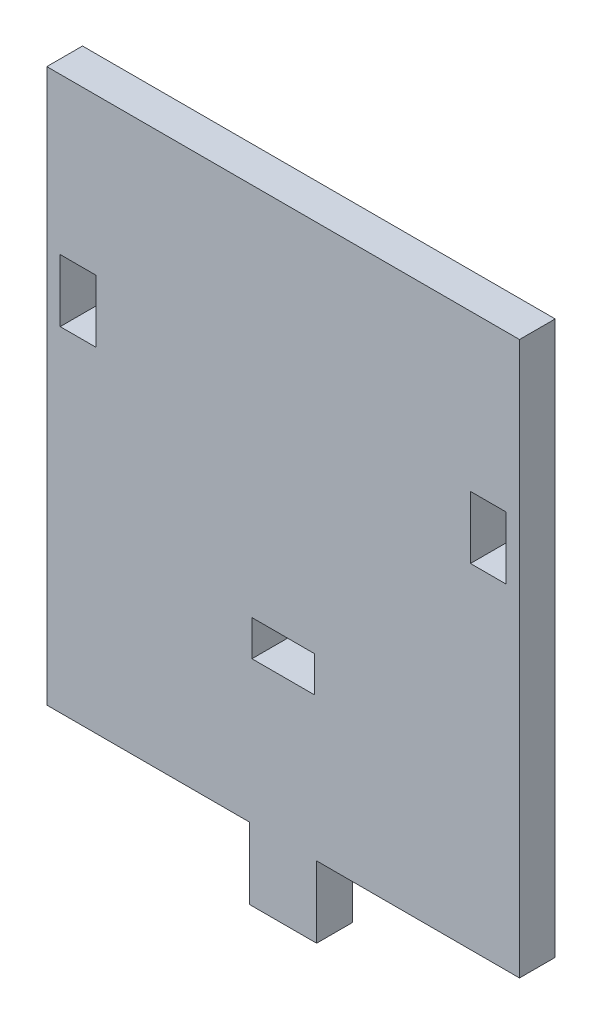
ISO-10303-21;
HEADER;
FILE_DESCRIPTION(('STEP AP214'),'2;1');
FILE_NAME('part.step','',(''),(''),'','','');
FILE_SCHEMA(('AUTOMOTIVE_DESIGN { 1 0 10303 214 1 1 1 1 }'));
ENDSEC;
DATA;
#1=APPLICATION_CONTEXT('core data for automotive mechanical design processes');
#2=APPLICATION_PROTOCOL_DEFINITION('international standard','automotive_design',2000,#1);
#3=PRODUCT_CONTEXT('',#1,'mechanical');
#4=PRODUCT('Part','Part','',(#3));
#5=PRODUCT_RELATED_PRODUCT_CATEGORY('part','',(#4));
#6=PRODUCT_DEFINITION_FORMATION('','',#4);
#7=PRODUCT_DEFINITION_CONTEXT('part definition',#1,'design');
#8=PRODUCT_DEFINITION('design','',#6,#7);
#9=PRODUCT_DEFINITION_SHAPE('','',#8);
#10=(LENGTH_UNIT() NAMED_UNIT(*) SI_UNIT(.MILLI.,.METRE.));
#11=(NAMED_UNIT(*) PLANE_ANGLE_UNIT() SI_UNIT($,.RADIAN.));
#12=(NAMED_UNIT(*) SI_UNIT($,.STERADIAN.) SOLID_ANGLE_UNIT());
#13=UNCERTAINTY_MEASURE_WITH_UNIT(LENGTH_MEASURE(1.E-05),#10,'distance_accuracy_value','');
#14=(GEOMETRIC_REPRESENTATION_CONTEXT(3) GLOBAL_UNCERTAINTY_ASSIGNED_CONTEXT((#13)) GLOBAL_UNIT_ASSIGNED_CONTEXT((#10,
#11,#12)) REPRESENTATION_CONTEXT('',''));
#15=CARTESIAN_POINT('',(0.,0.,0.));
#16=DIRECTION('',(0.,0.,1.));
#17=DIRECTION('',(1.,0.,0.));
#18=AXIS2_PLACEMENT_3D('',#15,#16,#17);
#19=CARTESIAN_POINT('',(-0.298886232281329,0.,4.));
#20=DIRECTION('',(1.,0.,0.));
#21=DIRECTION('',(0.,1.,0.));
#22=AXIS2_PLACEMENT_3D('',#19,#20,#21);
#23=PLANE('',#22);
#24=DIRECTION('',(0.,-1.,0.));
#25=VECTOR('',#24,1.);
#26=CARTESIAN_POINT('',(-0.298886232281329,0.,0.));
#27=LINE('',#26,#25);
#28=CARTESIAN_POINT('',(-0.298886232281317,-55.3647060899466,0.));
#29=VERTEX_POINT('',#28);
#30=CARTESIAN_POINT('',(-0.298886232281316,-63.3647060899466,0.));
#31=VERTEX_POINT('',#30);
#32=EDGE_CURVE('E283',#29,#31,#27,.T.);
#33=ORIENTED_EDGE('',*,*,#32,.F.);
#34=DIRECTION('',(0.,0.,-1.));
#35=VECTOR('',#34,1.);
#36=CARTESIAN_POINT('',(-0.298886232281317,-55.3647060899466,4.));
#37=LINE('',#36,#35);
#38=CARTESIAN_POINT('',(-0.298886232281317,-55.3647060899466,4.));
#39=VERTEX_POINT('',#38);
#40=EDGE_CURVE('E11',#39,#29,#37,.T.);
#41=ORIENTED_EDGE('',*,*,#40,.F.);
#42=DIRECTION('',(0.,-1.,0.));
#43=VECTOR('',#42,1.);
#44=CARTESIAN_POINT('',(-0.298886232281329,0.,4.));
#45=LINE('',#44,#43);
#46=CARTESIAN_POINT('',(-0.298886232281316,-63.3647060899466,4.));
#47=VERTEX_POINT('',#46);
#48=EDGE_CURVE('E334',#39,#47,#45,.T.);
#49=ORIENTED_EDGE('',*,*,#48,.T.);
#50=DIRECTION('',(0.,0.,-1.));
#51=VECTOR('',#50,1.);
#52=CARTESIAN_POINT('',(-0.298886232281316,-63.3647060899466,4.));
#53=LINE('',#52,#51);
#54=EDGE_CURVE('E121',#47,#31,#53,.T.);
#55=ORIENTED_EDGE('',*,*,#54,.T.);
#56=EDGE_LOOP('',(#33,#41,#49,#55));
#57=FACE_BOUND('',#56,.T.);
#58=ADVANCED_FACE('F32',(#57),#23,.T.);
#59=CARTESIAN_POINT('',(0.,-55.3647060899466,4.));
#60=DIRECTION('',(0.,1.,0.));
#61=DIRECTION('',(0.,0.,1.));
#62=AXIS2_PLACEMENT_3D('',#59,#60,#61);
#63=PLANE('',#62);
#64=DIRECTION('',(1.,0.,0.));
#65=VECTOR('',#64,1.);
#66=CARTESIAN_POINT('',(0.,-55.3647060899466,0.));
#67=LINE('',#66,#65);
#68=CARTESIAN_POINT('',(22.4511137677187,-55.3647060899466,0.));
#69=VERTEX_POINT('',#68);
#70=EDGE_CURVE('E285',#29,#69,#67,.T.);
#71=ORIENTED_EDGE('',*,*,#70,.T.);
#72=DIRECTION('',(0.,0.,-1.));
#73=VECTOR('',#72,1.);
#74=CARTESIAN_POINT('',(22.4511137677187,-55.3647060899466,4.));
#75=LINE('',#74,#73);
#76=CARTESIAN_POINT('',(22.4511137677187,-55.3647060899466,4.));
#77=VERTEX_POINT('',#76);
#78=EDGE_CURVE('E42',#77,#69,#75,.T.);
#79=ORIENTED_EDGE('',*,*,#78,.F.);
#80=DIRECTION('',(1.,0.,0.));
#81=VECTOR('',#80,1.);
#82=CARTESIAN_POINT('',(0.,-55.3647060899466,4.));
#83=LINE('',#82,#81);
#84=EDGE_CURVE('E336',#39,#77,#83,.T.);
#85=ORIENTED_EDGE('',*,*,#84,.F.);
#86=ORIENTED_EDGE('',*,*,#40,.T.);
#87=EDGE_LOOP('',(#71,#79,#85,#86));
#88=FACE_BOUND('',#87,.T.);
#89=ADVANCED_FACE('F367',(#88),#63,.F.);
#90=CARTESIAN_POINT('',(22.4511137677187,0.,4.));
#91=DIRECTION('',(1.,0.,0.));
#92=DIRECTION('',(0.,1.,0.));
#93=AXIS2_PLACEMENT_3D('',#90,#91,#92);
#94=PLANE('',#93);
#95=DIRECTION('',(0.,-1.,0.));
#96=VECTOR('',#95,1.);
#97=CARTESIAN_POINT('',(22.4511137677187,0.,0.));
#98=LINE('',#97,#96);
#99=CARTESIAN_POINT('',(22.4511137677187,6.63529391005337,0.));
#100=VERTEX_POINT('',#99);
#101=EDGE_CURVE('E288',#100,#69,#98,.T.);
#102=ORIENTED_EDGE('',*,*,#101,.F.);
#103=DIRECTION('',(0.,0.,-1.));
#104=VECTOR('',#103,1.);
#105=CARTESIAN_POINT('',(22.4511137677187,6.63529391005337,4.));
#106=LINE('',#105,#104);
#107=CARTESIAN_POINT('',(22.4511137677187,6.63529391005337,4.));
#108=VERTEX_POINT('',#107);
#109=EDGE_CURVE('E210',#108,#100,#106,.T.);
#110=ORIENTED_EDGE('',*,*,#109,.F.);
#111=DIRECTION('',(0.,-1.,0.));
#112=VECTOR('',#111,1.);
#113=CARTESIAN_POINT('',(22.4511137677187,0.,4.));
#114=LINE('',#113,#112);
#115=EDGE_CURVE('E338',#108,#77,#114,.T.);
#116=ORIENTED_EDGE('',*,*,#115,.T.);
#117=ORIENTED_EDGE('',*,*,#78,.T.);
#118=EDGE_LOOP('',(#102,#110,#116,#117));
#119=FACE_BOUND('',#118,.T.);
#120=ADVANCED_FACE('F352',(#119),#94,.T.);
#121=CARTESIAN_POINT('',(0.,6.63529391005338,4.));
#122=DIRECTION('',(0.,1.,0.));
#123=DIRECTION('',(-1.,0.,0.));
#124=AXIS2_PLACEMENT_3D('',#121,#122,#123);
#125=PLANE('',#124);
#126=DIRECTION('',(1.,0.,0.));
#127=VECTOR('',#126,1.);
#128=CARTESIAN_POINT('',(0.,6.63529391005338,0.));
#129=LINE('',#128,#127);
#130=CARTESIAN_POINT('',(-30.5488862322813,6.63529391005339,0.));
#131=VERTEX_POINT('',#130);
#132=EDGE_CURVE('E291',#131,#100,#129,.T.);
#133=ORIENTED_EDGE('',*,*,#132,.F.);
#134=DIRECTION('',(0.,0.,-1.));
#135=VECTOR('',#134,1.);
#136=CARTESIAN_POINT('',(-30.5488862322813,6.63529391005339,4.));
#137=LINE('',#136,#135);
#138=CARTESIAN_POINT('',(-30.5488862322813,6.63529391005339,4.));
#139=VERTEX_POINT('',#138);
#140=EDGE_CURVE('E204',#139,#131,#137,.T.);
#141=ORIENTED_EDGE('',*,*,#140,.F.);
#142=DIRECTION('',(1.,0.,0.));
#143=VECTOR('',#142,1.);
#144=CARTESIAN_POINT('',(0.,6.63529391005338,4.));
#145=LINE('',#144,#143);
#146=EDGE_CURVE('E341',#139,#108,#145,.T.);
#147=ORIENTED_EDGE('',*,*,#146,.T.);
#148=ORIENTED_EDGE('',*,*,#109,.T.);
#149=EDGE_LOOP('',(#133,#141,#147,#148));
#150=FACE_BOUND('',#149,.T.);
#151=ADVANCED_FACE('F346',(#150),#125,.T.);
#152=CARTESIAN_POINT('',(-30.5488862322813,0.,4.));
#153=DIRECTION('',(1.,0.,0.));
#154=DIRECTION('',(0.,1.,0.));
#155=AXIS2_PLACEMENT_3D('',#152,#153,#154);
#156=PLANE('',#155);
#157=DIRECTION('',(0.,-1.,0.));
#158=VECTOR('',#157,1.);
#159=CARTESIAN_POINT('',(-30.5488862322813,0.,0.));
#160=LINE('',#159,#158);
#161=CARTESIAN_POINT('',(-30.5488862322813,-55.3647060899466,0.));
#162=VERTEX_POINT('',#161);
#163=EDGE_CURVE('E294',#131,#162,#160,.T.);
#164=ORIENTED_EDGE('',*,*,#163,.T.);
#165=DIRECTION('',(0.,0.,-1.));
#166=VECTOR('',#165,1.);
#167=CARTESIAN_POINT('',(-30.5488862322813,-55.3647060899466,4.));
#168=LINE('',#167,#166);
#169=CARTESIAN_POINT('',(-30.5488862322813,-55.3647060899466,4.));
#170=VERTEX_POINT('',#169);
#171=EDGE_CURVE('E202',#170,#162,#168,.T.);
#172=ORIENTED_EDGE('',*,*,#171,.F.);
#173=DIRECTION('',(0.,-1.,0.));
#174=VECTOR('',#173,1.);
#175=CARTESIAN_POINT('',(-30.5488862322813,0.,4.));
#176=LINE('',#175,#174);
#177=EDGE_CURVE('E195',#139,#170,#176,.T.);
#178=ORIENTED_EDGE('',*,*,#177,.F.);
#179=ORIENTED_EDGE('',*,*,#140,.T.);
#180=EDGE_LOOP('',(#164,#172,#178,#179));
#181=FACE_BOUND('',#180,.T.);
#182=ADVANCED_FACE('F357',(#181),#156,.F.);
#183=CARTESIAN_POINT('',(0.,-55.3647060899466,4.));
#184=DIRECTION('',(0.,1.,0.));
#185=DIRECTION('',(0.,0.,1.));
#186=AXIS2_PLACEMENT_3D('',#183,#184,#185);
#187=PLANE('',#186);
#188=DIRECTION('',(1.,0.,0.));
#189=VECTOR('',#188,1.);
#190=CARTESIAN_POINT('',(0.,-55.3647060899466,0.));
#191=LINE('',#190,#189);
#192=CARTESIAN_POINT('',(-7.79888623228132,-55.3647060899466,0.));
#193=VERTEX_POINT('',#192);
#194=EDGE_CURVE('E201',#162,#193,#191,.T.);
#195=ORIENTED_EDGE('',*,*,#194,.T.);
#196=DIRECTION('',(0.,0.,-1.));
#197=VECTOR('',#196,1.);
#198=CARTESIAN_POINT('',(-7.79888623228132,-55.3647060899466,4.));
#199=LINE('',#198,#197);
#200=CARTESIAN_POINT('',(-7.79888623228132,-55.3647060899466,4.));
#201=VERTEX_POINT('',#200);
#202=EDGE_CURVE('E186',#201,#193,#199,.T.);
#203=ORIENTED_EDGE('',*,*,#202,.F.);
#204=DIRECTION('',(1.,0.,0.));
#205=VECTOR('',#204,1.);
#206=CARTESIAN_POINT('',(0.,-55.3647060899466,4.));
#207=LINE('',#206,#205);
#208=EDGE_CURVE('E189',#170,#201,#207,.T.);
#209=ORIENTED_EDGE('',*,*,#208,.F.);
#210=ORIENTED_EDGE('',*,*,#171,.T.);
#211=EDGE_LOOP('',(#195,#203,#209,#210));
#212=FACE_BOUND('',#211,.T.);
#213=ADVANCED_FACE('F200',(#212),#187,.F.);
#214=CARTESIAN_POINT('',(-7.79888623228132,0.,4.));
#215=DIRECTION('',(1.,0.,0.));
#216=DIRECTION('',(0.,1.,0.));
#217=AXIS2_PLACEMENT_3D('',#214,#215,#216);
#218=PLANE('',#217);
#219=DIRECTION('',(0.,-1.,0.));
#220=VECTOR('',#219,1.);
#221=CARTESIAN_POINT('',(-7.79888623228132,0.,0.));
#222=LINE('',#221,#220);
#223=CARTESIAN_POINT('',(-7.79888623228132,-63.3647060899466,0.));
#224=VERTEX_POINT('',#223);
#225=EDGE_CURVE('E298',#193,#224,#222,.T.);
#226=ORIENTED_EDGE('',*,*,#225,.T.);
#227=DIRECTION('',(0.,0.,-1.));
#228=VECTOR('',#227,1.);
#229=CARTESIAN_POINT('',(-7.79888623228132,-63.3647060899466,4.));
#230=LINE('',#229,#228);
#231=CARTESIAN_POINT('',(-7.79888623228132,-63.3647060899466,4.));
#232=VERTEX_POINT('',#231);
#233=EDGE_CURVE('E188',#232,#224,#230,.T.);
#234=ORIENTED_EDGE('',*,*,#233,.F.);
#235=DIRECTION('',(0.,-1.,0.));
#236=VECTOR('',#235,1.);
#237=CARTESIAN_POINT('',(-7.79888623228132,0.,4.));
#238=LINE('',#237,#236);
#239=EDGE_CURVE('E181',#201,#232,#238,.T.);
#240=ORIENTED_EDGE('',*,*,#239,.F.);
#241=ORIENTED_EDGE('',*,*,#202,.T.);
#242=EDGE_LOOP('',(#226,#234,#240,#241));
#243=FACE_BOUND('',#242,.T.);
#244=ADVANCED_FACE('F184',(#243),#218,.F.);
#245=CARTESIAN_POINT('',(0.,-35.3647060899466,4.));
#246=DIRECTION('',(0.,1.,0.));
#247=DIRECTION('',(0.,0.,1.));
#248=AXIS2_PLACEMENT_3D('',#245,#246,#247);
#249=PLANE('',#248);
#250=DIRECTION('',(1.,0.,0.));
#251=VECTOR('',#250,1.);
#252=CARTESIAN_POINT('',(0.,-35.3647060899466,0.));
#253=LINE('',#252,#251);
#254=CARTESIAN_POINT('',(-7.54888623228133,-35.3647060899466,0.));
#255=VERTEX_POINT('',#254);
#256=CARTESIAN_POINT('',(-0.548886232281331,-35.3647060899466,0.));
#257=VERTEX_POINT('',#256);
#258=EDGE_CURVE('E271',#255,#257,#253,.T.);
#259=ORIENTED_EDGE('',*,*,#258,.T.);
#260=DIRECTION('',(0.,0.,-1.));
#261=VECTOR('',#260,1.);
#262=CARTESIAN_POINT('',(-0.548886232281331,-35.3647060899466,4.));
#263=LINE('',#262,#261);
#264=CARTESIAN_POINT('',(-0.548886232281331,-35.3647060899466,4.));
#265=VERTEX_POINT('',#264);
#266=EDGE_CURVE('E220',#265,#257,#263,.T.);
#267=ORIENTED_EDGE('',*,*,#266,.F.);
#268=DIRECTION('',(1.,0.,0.));
#269=VECTOR('',#268,1.);
#270=CARTESIAN_POINT('',(0.,-35.3647060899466,4.));
#271=LINE('',#270,#269);
#272=CARTESIAN_POINT('',(-7.54888623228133,-35.3647060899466,4.));
#273=VERTEX_POINT('',#272);
#274=EDGE_CURVE('E323',#273,#265,#271,.T.);
#275=ORIENTED_EDGE('',*,*,#274,.F.);
#276=DIRECTION('',(0.,0.,-1.));
#277=VECTOR('',#276,1.);
#278=CARTESIAN_POINT('',(-7.54888623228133,-35.3647060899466,4.));
#279=LINE('',#278,#277);
#280=EDGE_CURVE('E213',#273,#255,#279,.T.);
#281=ORIENTED_EDGE('',*,*,#280,.T.);
#282=EDGE_LOOP('',(#259,#267,#275,#281));
#283=FACE_BOUND('',#282,.T.);
#284=ADVANCED_FACE('F390',(#283),#249,.F.);
#285=CARTESIAN_POINT('',(-0.548886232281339,0.,4.));
#286=DIRECTION('',(1.,0.,0.));
#287=DIRECTION('',(0.,1.,0.));
#288=AXIS2_PLACEMENT_3D('',#285,#286,#287);
#289=PLANE('',#288);
#290=DIRECTION('',(0.,-1.,0.));
#291=VECTOR('',#290,1.);
#292=CARTESIAN_POINT('',(-0.548886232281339,0.,0.));
#293=LINE('',#292,#291);
#294=CARTESIAN_POINT('',(-0.548886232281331,-39.3647060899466,0.));
#295=VERTEX_POINT('',#294);
#296=EDGE_CURVE('E274',#257,#295,#293,.T.);
#297=ORIENTED_EDGE('',*,*,#296,.T.);
#298=DIRECTION('',(0.,0.,-1.));
#299=VECTOR('',#298,1.);
#300=CARTESIAN_POINT('',(-0.548886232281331,-39.3647060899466,4.));
#301=LINE('',#300,#299);
#302=CARTESIAN_POINT('',(-0.548886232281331,-39.3647060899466,4.));
#303=VERTEX_POINT('',#302);
#304=EDGE_CURVE('E218',#303,#295,#301,.T.);
#305=ORIENTED_EDGE('',*,*,#304,.F.);
#306=DIRECTION('',(0.,-1.,0.));
#307=VECTOR('',#306,1.);
#308=CARTESIAN_POINT('',(-0.548886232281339,0.,4.));
#309=LINE('',#308,#307);
#310=EDGE_CURVE('E326',#265,#303,#309,.T.);
#311=ORIENTED_EDGE('',*,*,#310,.F.);
#312=ORIENTED_EDGE('',*,*,#266,.T.);
#313=EDGE_LOOP('',(#297,#305,#311,#312));
#314=FACE_BOUND('',#313,.T.);
#315=ADVANCED_FACE('F386',(#314),#289,.F.);
#316=CARTESIAN_POINT('',(0.,-39.3647060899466,4.));
#317=DIRECTION('',(0.,1.,0.));
#318=DIRECTION('',(0.,0.,1.));
#319=AXIS2_PLACEMENT_3D('',#316,#317,#318);
#320=PLANE('',#319);
#321=DIRECTION('',(1.,0.,0.));
#322=VECTOR('',#321,1.);
#323=CARTESIAN_POINT('',(0.,-39.3647060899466,0.));
#324=LINE('',#323,#322);
#325=CARTESIAN_POINT('',(-7.54888623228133,-39.3647060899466,0.));
#326=VERTEX_POINT('',#325);
#327=EDGE_CURVE('E277',#326,#295,#324,.T.);
#328=ORIENTED_EDGE('',*,*,#327,.F.);
#329=DIRECTION('',(0.,0.,-1.));
#330=VECTOR('',#329,1.);
#331=CARTESIAN_POINT('',(-7.54888623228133,-39.3647060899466,4.));
#332=LINE('',#331,#330);
#333=CARTESIAN_POINT('',(-7.54888623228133,-39.3647060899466,4.));
#334=VERTEX_POINT('',#333);
#335=EDGE_CURVE('E215',#334,#326,#332,.T.);
#336=ORIENTED_EDGE('',*,*,#335,.F.);
#337=DIRECTION('',(1.,0.,0.));
#338=VECTOR('',#337,1.);
#339=CARTESIAN_POINT('',(0.,-39.3647060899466,4.));
#340=LINE('',#339,#338);
#341=EDGE_CURVE('E328',#334,#303,#340,.T.);
#342=ORIENTED_EDGE('',*,*,#341,.T.);
#343=ORIENTED_EDGE('',*,*,#304,.T.);
#344=EDGE_LOOP('',(#328,#336,#342,#343));
#345=FACE_BOUND('',#344,.T.);
#346=ADVANCED_FACE('F382',(#345),#320,.T.);
#347=CARTESIAN_POINT('',(0.,-10.8647060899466,4.));
#348=DIRECTION('',(0.,1.,0.));
#349=DIRECTION('',(0.,0.,1.));
#350=AXIS2_PLACEMENT_3D('',#347,#348,#349);
#351=PLANE('',#350);
#352=DIRECTION('',(1.,0.,0.));
#353=VECTOR('',#352,1.);
#354=CARTESIAN_POINT('',(0.,-10.8647060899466,0.));
#355=LINE('',#354,#353);
#356=CARTESIAN_POINT('',(-29.0488862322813,-10.8647060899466,0.));
#357=VERTEX_POINT('',#356);
#358=CARTESIAN_POINT('',(-25.0488862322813,-10.8647060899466,0.));
#359=VERTEX_POINT('',#358);
#360=EDGE_CURVE('E259',#357,#359,#355,.T.);
#361=ORIENTED_EDGE('',*,*,#360,.T.);
#362=DIRECTION('',(0.,0.,-1.));
#363=VECTOR('',#362,1.);
#364=CARTESIAN_POINT('',(-25.0488862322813,-10.8647060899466,4.));
#365=LINE('',#364,#363);
#366=CARTESIAN_POINT('',(-25.0488862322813,-10.8647060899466,4.));
#367=VERTEX_POINT('',#366);
#368=EDGE_CURVE('E216',#367,#359,#365,.T.);
#369=ORIENTED_EDGE('',*,*,#368,.F.);
#370=DIRECTION('',(1.,0.,0.));
#371=VECTOR('',#370,1.);
#372=CARTESIAN_POINT('',(0.,-10.8647060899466,4.));
#373=LINE('',#372,#371);
#374=CARTESIAN_POINT('',(-29.0488862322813,-10.8647060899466,4.));
#375=VERTEX_POINT('',#374);
#376=EDGE_CURVE('E312',#375,#367,#373,.T.);
#377=ORIENTED_EDGE('',*,*,#376,.F.);
#378=DIRECTION('',(0.,0.,-1.));
#379=VECTOR('',#378,1.);
#380=CARTESIAN_POINT('',(-29.0488862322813,-10.8647060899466,4.));
#381=LINE('',#380,#379);
#382=EDGE_CURVE('E223',#375,#357,#381,.T.);
#383=ORIENTED_EDGE('',*,*,#382,.T.);
#384=EDGE_LOOP('',(#361,#369,#377,#383));
#385=FACE_BOUND('',#384,.T.);
#386=ADVANCED_FACE('F385',(#385),#351,.F.);
#387=CARTESIAN_POINT('',(-25.0488862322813,0.,4.));
#388=DIRECTION('',(1.,0.,0.));
#389=DIRECTION('',(0.,0.,-1.));
#390=AXIS2_PLACEMENT_3D('',#387,#388,#389);
#391=PLANE('',#390);
#392=DIRECTION('',(0.,-1.,0.));
#393=VECTOR('',#392,1.);
#394=CARTESIAN_POINT('',(-25.0488862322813,0.,0.));
#395=LINE('',#394,#393);
#396=CARTESIAN_POINT('',(-25.0488862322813,-17.8647060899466,0.));
#397=VERTEX_POINT('',#396);
#398=EDGE_CURVE('E262',#359,#397,#395,.T.);
#399=ORIENTED_EDGE('',*,*,#398,.T.);
#400=DIRECTION('',(0.,0.,-1.));
#401=VECTOR('',#400,1.);
#402=CARTESIAN_POINT('',(-25.0488862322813,-17.8647060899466,4.));
#403=LINE('',#402,#401);
#404=CARTESIAN_POINT('',(-25.0488862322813,-17.8647060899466,4.));
#405=VERTEX_POINT('',#404);
#406=EDGE_CURVE('E227',#405,#397,#403,.T.);
#407=ORIENTED_EDGE('',*,*,#406,.F.);
#408=DIRECTION('',(0.,-1.,0.));
#409=VECTOR('',#408,1.);
#410=CARTESIAN_POINT('',(-25.0488862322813,0.,4.));
#411=LINE('',#410,#409);
#412=EDGE_CURVE('E315',#367,#405,#411,.T.);
#413=ORIENTED_EDGE('',*,*,#412,.F.);
#414=ORIENTED_EDGE('',*,*,#368,.T.);
#415=EDGE_LOOP('',(#399,#407,#413,#414));
#416=FACE_BOUND('',#415,.T.);
#417=ADVANCED_FACE('F402',(#416),#391,.F.);
#418=CARTESIAN_POINT('',(0.,-17.8647060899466,4.));
#419=DIRECTION('',(0.,1.,0.));
#420=DIRECTION('',(0.,0.,1.));
#421=AXIS2_PLACEMENT_3D('',#418,#419,#420);
#422=PLANE('',#421);
#423=DIRECTION('',(1.,0.,0.));
#424=VECTOR('',#423,1.);
#425=CARTESIAN_POINT('',(0.,-17.8647060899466,0.));
#426=LINE('',#425,#424);
#427=CARTESIAN_POINT('',(-29.0488862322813,-17.8647060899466,0.));
#428=VERTEX_POINT('',#427);
#429=EDGE_CURVE('E265',#428,#397,#426,.T.);
#430=ORIENTED_EDGE('',*,*,#429,.F.);
#431=DIRECTION('',(0.,0.,-1.));
#432=VECTOR('',#431,1.);
#433=CARTESIAN_POINT('',(-29.0488862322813,-17.8647060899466,4.));
#434=LINE('',#433,#432);
#435=CARTESIAN_POINT('',(-29.0488862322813,-17.8647060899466,4.));
#436=VERTEX_POINT('',#435);
#437=EDGE_CURVE('E225',#436,#428,#434,.T.);
#438=ORIENTED_EDGE('',*,*,#437,.F.);
#439=DIRECTION('',(1.,0.,0.));
#440=VECTOR('',#439,1.);
#441=CARTESIAN_POINT('',(0.,-17.8647060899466,4.));
#442=LINE('',#441,#440);
#443=EDGE_CURVE('E317',#436,#405,#442,.T.);
#444=ORIENTED_EDGE('',*,*,#443,.T.);
#445=ORIENTED_EDGE('',*,*,#406,.T.);
#446=EDGE_LOOP('',(#430,#438,#444,#445));
#447=FACE_BOUND('',#446,.T.);
#448=ADVANCED_FACE('F399',(#447),#422,.T.);
#449=CARTESIAN_POINT('',(0.,-10.8647060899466,4.));
#450=DIRECTION('',(0.,1.,0.));
#451=DIRECTION('',(0.,0.,1.));
#452=AXIS2_PLACEMENT_3D('',#449,#450,#451);
#453=PLANE('',#452);
#454=DIRECTION('',(1.,0.,0.));
#455=VECTOR('',#454,1.);
#456=CARTESIAN_POINT('',(0.,-10.8647060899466,0.));
#457=LINE('',#456,#455);
#458=CARTESIAN_POINT('',(16.9511137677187,-10.8647060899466,0.));
#459=VERTEX_POINT('',#458);
#460=CARTESIAN_POINT('',(20.9511137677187,-10.8647060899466,0.));
#461=VERTEX_POINT('',#460);
#462=EDGE_CURVE('E247',#459,#461,#457,.T.);
#463=ORIENTED_EDGE('',*,*,#462,.T.);
#464=DIRECTION('',(0.,0.,-1.));
#465=VECTOR('',#464,1.);
#466=CARTESIAN_POINT('',(20.9511137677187,-10.8647060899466,4.));
#467=LINE('',#466,#465);
#468=CARTESIAN_POINT('',(20.9511137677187,-10.8647060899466,4.));
#469=VERTEX_POINT('',#468);
#470=EDGE_CURVE('E36',#469,#461,#467,.T.);
#471=ORIENTED_EDGE('',*,*,#470,.F.);
#472=DIRECTION('',(1.,0.,0.));
#473=VECTOR('',#472,1.);
#474=CARTESIAN_POINT('',(0.,-10.8647060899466,4.));
#475=LINE('',#474,#473);
#476=CARTESIAN_POINT('',(16.9511137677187,-10.8647060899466,4.));
#477=VERTEX_POINT('',#476);
#478=EDGE_CURVE('E300',#477,#469,#475,.T.);
#479=ORIENTED_EDGE('',*,*,#478,.F.);
#480=DIRECTION('',(0.,0.,-1.));
#481=VECTOR('',#480,1.);
#482=CARTESIAN_POINT('',(16.9511137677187,-10.8647060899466,4.));
#483=LINE('',#482,#481);
#484=EDGE_CURVE('E231',#477,#459,#483,.T.);
#485=ORIENTED_EDGE('',*,*,#484,.T.);
#486=EDGE_LOOP('',(#463,#471,#479,#485));
#487=FACE_BOUND('',#486,.T.);
#488=ADVANCED_FACE('F34',(#487),#453,.F.);
#489=CARTESIAN_POINT('',(20.9511137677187,0.,4.));
#490=DIRECTION('',(1.,0.,0.));
#491=DIRECTION('',(0.,0.,-1.));
#492=AXIS2_PLACEMENT_3D('',#489,#490,#491);
#493=PLANE('',#492);
#494=DIRECTION('',(0.,-1.,0.));
#495=VECTOR('',#494,1.);
#496=CARTESIAN_POINT('',(20.9511137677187,0.,0.));
#497=LINE('',#496,#495);
#498=CARTESIAN_POINT('',(20.9511137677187,-17.8647060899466,0.));
#499=VERTEX_POINT('',#498);
#500=EDGE_CURVE('E242',#461,#499,#497,.T.);
#501=ORIENTED_EDGE('',*,*,#500,.T.);
#502=DIRECTION('',(0.,0.,-1.));
#503=VECTOR('',#502,1.);
#504=CARTESIAN_POINT('',(20.9511137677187,-17.8647060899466,4.));
#505=LINE('',#504,#503);
#506=CARTESIAN_POINT('',(20.9511137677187,-17.8647060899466,4.));
#507=VERTEX_POINT('',#506);
#508=EDGE_CURVE('E234',#507,#499,#505,.T.);
#509=ORIENTED_EDGE('',*,*,#508,.F.);
#510=DIRECTION('',(0.,-1.,0.));
#511=VECTOR('',#510,1.);
#512=CARTESIAN_POINT('',(20.9511137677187,0.,4.));
#513=LINE('',#512,#511);
#514=EDGE_CURVE('E129',#469,#507,#513,.T.);
#515=ORIENTED_EDGE('',*,*,#514,.F.);
#516=ORIENTED_EDGE('',*,*,#470,.T.);
#517=EDGE_LOOP('',(#501,#509,#515,#516));
#518=FACE_BOUND('',#517,.T.);
#519=ADVANCED_FACE('F241',(#518),#493,.F.);
#520=CARTESIAN_POINT('',(0.,-17.8647060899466,4.));
#521=DIRECTION('',(0.,1.,0.));
#522=DIRECTION('',(0.,0.,1.));
#523=AXIS2_PLACEMENT_3D('',#520,#521,#522);
#524=PLANE('',#523);
#525=DIRECTION('',(1.,0.,0.));
#526=VECTOR('',#525,1.);
#527=CARTESIAN_POINT('',(0.,-17.8647060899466,0.));
#528=LINE('',#527,#526);
#529=CARTESIAN_POINT('',(16.9511137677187,-17.8647060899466,0.));
#530=VERTEX_POINT('',#529);
#531=EDGE_CURVE('E252',#530,#499,#528,.T.);
#532=ORIENTED_EDGE('',*,*,#531,.F.);
#533=DIRECTION('',(0.,0.,-1.));
#534=VECTOR('',#533,1.);
#535=CARTESIAN_POINT('',(16.9511137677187,-17.8647060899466,4.));
#536=LINE('',#535,#534);
#537=CARTESIAN_POINT('',(16.9511137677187,-17.8647060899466,4.));
#538=VERTEX_POINT('',#537);
#539=EDGE_CURVE('E233',#538,#530,#536,.T.);
#540=ORIENTED_EDGE('',*,*,#539,.F.);
#541=DIRECTION('',(1.,0.,0.));
#542=VECTOR('',#541,1.);
#543=CARTESIAN_POINT('',(0.,-17.8647060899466,4.));
#544=LINE('',#543,#542);
#545=EDGE_CURVE('E305',#538,#507,#544,.T.);
#546=ORIENTED_EDGE('',*,*,#545,.T.);
#547=ORIENTED_EDGE('',*,*,#508,.T.);
#548=EDGE_LOOP('',(#532,#540,#546,#547));
#549=FACE_BOUND('',#548,.T.);
#550=ADVANCED_FACE('F380',(#549),#524,.T.);
#551=CARTESIAN_POINT('',(-7.54888623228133,0.,4.));
#552=DIRECTION('',(1.,0.,0.));
#553=DIRECTION('',(0.,0.,-1.));
#554=AXIS2_PLACEMENT_3D('',#551,#552,#553);
#555=PLANE('',#554);
#556=DIRECTION('',(0.,-1.,0.));
#557=VECTOR('',#556,1.);
#558=CARTESIAN_POINT('',(-7.54888623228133,0.,0.));
#559=LINE('',#558,#557);
#560=EDGE_CURVE('E280',#255,#326,#559,.T.);
#561=ORIENTED_EDGE('',*,*,#560,.F.);
#562=ORIENTED_EDGE('',*,*,#280,.F.);
#563=DIRECTION('',(0.,-1.,0.));
#564=VECTOR('',#563,1.);
#565=CARTESIAN_POINT('',(-7.54888623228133,0.,4.));
#566=LINE('',#565,#564);
#567=EDGE_CURVE('E331',#273,#334,#566,.T.);
#568=ORIENTED_EDGE('',*,*,#567,.T.);
#569=ORIENTED_EDGE('',*,*,#335,.T.);
#570=EDGE_LOOP('',(#561,#562,#568,#569));
#571=FACE_BOUND('',#570,.T.);
#572=ADVANCED_FACE('F376',(#571),#555,.T.);
#573=CARTESIAN_POINT('',(-29.0488862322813,0.,4.));
#574=DIRECTION('',(1.,0.,0.));
#575=DIRECTION('',(0.,0.,-1.));
#576=AXIS2_PLACEMENT_3D('',#573,#574,#575);
#577=PLANE('',#576);
#578=DIRECTION('',(0.,-1.,0.));
#579=VECTOR('',#578,1.);
#580=CARTESIAN_POINT('',(-29.0488862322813,0.,0.));
#581=LINE('',#580,#579);
#582=EDGE_CURVE('E268',#357,#428,#581,.T.);
#583=ORIENTED_EDGE('',*,*,#582,.F.);
#584=ORIENTED_EDGE('',*,*,#382,.F.);
#585=DIRECTION('',(0.,-1.,0.));
#586=VECTOR('',#585,1.);
#587=CARTESIAN_POINT('',(-29.0488862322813,0.,4.));
#588=LINE('',#587,#586);
#589=EDGE_CURVE('E320',#375,#436,#588,.T.);
#590=ORIENTED_EDGE('',*,*,#589,.T.);
#591=ORIENTED_EDGE('',*,*,#437,.T.);
#592=EDGE_LOOP('',(#583,#584,#590,#591));
#593=FACE_BOUND('',#592,.T.);
#594=ADVANCED_FACE('F379',(#593),#577,.T.);
#595=CARTESIAN_POINT('',(16.9511137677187,0.,4.));
#596=DIRECTION('',(1.,0.,0.));
#597=DIRECTION('',(0.,0.,-1.));
#598=AXIS2_PLACEMENT_3D('',#595,#596,#597);
#599=PLANE('',#598);
#600=DIRECTION('',(0.,-1.,0.));
#601=VECTOR('',#600,1.);
#602=CARTESIAN_POINT('',(16.9511137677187,0.,0.));
#603=LINE('',#602,#601);
#604=EDGE_CURVE('E257',#459,#530,#603,.T.);
#605=ORIENTED_EDGE('',*,*,#604,.F.);
#606=ORIENTED_EDGE('',*,*,#484,.F.);
#607=DIRECTION('',(0.,-1.,0.));
#608=VECTOR('',#607,1.);
#609=CARTESIAN_POINT('',(16.9511137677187,0.,4.));
#610=LINE('',#609,#608);
#611=EDGE_CURVE('E309',#477,#538,#610,.T.);
#612=ORIENTED_EDGE('',*,*,#611,.T.);
#613=ORIENTED_EDGE('',*,*,#539,.T.);
#614=EDGE_LOOP('',(#605,#606,#612,#613));
#615=FACE_BOUND('',#614,.T.);
#616=ADVANCED_FACE('F397',(#615),#599,.T.);
#617=CARTESIAN_POINT('',(0.,-63.3647060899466,4.));
#618=DIRECTION('',(0.,1.,0.));
#619=DIRECTION('',(0.,0.,1.));
#620=AXIS2_PLACEMENT_3D('',#617,#618,#619);
#621=PLANE('',#620);
#622=DIRECTION('',(1.,0.,0.));
#623=VECTOR('',#622,1.);
#624=CARTESIAN_POINT('',(0.,-63.3647060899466,0.));
#625=LINE('',#624,#623);
#626=EDGE_CURVE('E114',#224,#31,#625,.T.);
#627=ORIENTED_EDGE('',*,*,#626,.T.);
#628=ORIENTED_EDGE('',*,*,#54,.F.);
#629=DIRECTION('',(1.,0.,0.));
#630=VECTOR('',#629,1.);
#631=CARTESIAN_POINT('',(0.,-63.3647060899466,4.));
#632=LINE('',#631,#630);
#633=EDGE_CURVE('E51',#232,#47,#632,.T.);
#634=ORIENTED_EDGE('',*,*,#633,.F.);
#635=ORIENTED_EDGE('',*,*,#233,.T.);
#636=EDGE_LOOP('',(#627,#628,#634,#635));
#637=FACE_BOUND('',#636,.T.);
#638=ADVANCED_FACE('F412',(#637),#621,.F.);
#639=CARTESIAN_POINT('',(0.,0.,4.));
#640=DIRECTION('',(0.,0.,1.));
#641=DIRECTION('',(1.,0.,0.));
#642=AXIS2_PLACEMENT_3D('',#639,#640,#641);
#643=PLANE('',#642);
#644=ORIENTED_EDGE('',*,*,#478,.T.);
#645=ORIENTED_EDGE('',*,*,#514,.T.);
#646=ORIENTED_EDGE('',*,*,#545,.F.);
#647=ORIENTED_EDGE('',*,*,#611,.F.);
#648=EDGE_LOOP('',(#644,#645,#646,#647));
#649=FACE_BOUND('',#648,.T.);
#650=ORIENTED_EDGE('',*,*,#376,.T.);
#651=ORIENTED_EDGE('',*,*,#412,.T.);
#652=ORIENTED_EDGE('',*,*,#443,.F.);
#653=ORIENTED_EDGE('',*,*,#589,.F.);
#654=EDGE_LOOP('',(#650,#651,#652,#653));
#655=FACE_BOUND('',#654,.T.);
#656=ORIENTED_EDGE('',*,*,#274,.T.);
#657=ORIENTED_EDGE('',*,*,#310,.T.);
#658=ORIENTED_EDGE('',*,*,#341,.F.);
#659=ORIENTED_EDGE('',*,*,#567,.F.);
#660=EDGE_LOOP('',(#656,#657,#658,#659));
#661=FACE_BOUND('',#660,.T.);
#662=ORIENTED_EDGE('',*,*,#48,.F.);
#663=ORIENTED_EDGE('',*,*,#84,.T.);
#664=ORIENTED_EDGE('',*,*,#115,.F.);
#665=ORIENTED_EDGE('',*,*,#146,.F.);
#666=ORIENTED_EDGE('',*,*,#177,.T.);
#667=ORIENTED_EDGE('',*,*,#208,.T.);
#668=ORIENTED_EDGE('',*,*,#239,.T.);
#669=ORIENTED_EDGE('',*,*,#633,.T.);
#670=EDGE_LOOP('',(#662,#663,#664,#665,#666,#667,#668,#669));
#671=FACE_BOUND('',#670,.T.);
#672=ADVANCED_FACE('F192',(#649,#655,#661,#671),#643,.T.);
#673=CARTESIAN_POINT('',(0.,0.,0.));
#674=DIRECTION('',(0.,0.,1.));
#675=DIRECTION('',(1.,0.,0.));
#676=AXIS2_PLACEMENT_3D('',#673,#674,#675);
#677=PLANE('',#676);
#678=ORIENTED_EDGE('',*,*,#462,.F.);
#679=ORIENTED_EDGE('',*,*,#604,.T.);
#680=ORIENTED_EDGE('',*,*,#531,.T.);
#681=ORIENTED_EDGE('',*,*,#500,.F.);
#682=EDGE_LOOP('',(#678,#679,#680,#681));
#683=FACE_BOUND('',#682,.T.);
#684=ORIENTED_EDGE('',*,*,#360,.F.);
#685=ORIENTED_EDGE('',*,*,#582,.T.);
#686=ORIENTED_EDGE('',*,*,#429,.T.);
#687=ORIENTED_EDGE('',*,*,#398,.F.);
#688=EDGE_LOOP('',(#684,#685,#686,#687));
#689=FACE_BOUND('',#688,.T.);
#690=ORIENTED_EDGE('',*,*,#258,.F.);
#691=ORIENTED_EDGE('',*,*,#560,.T.);
#692=ORIENTED_EDGE('',*,*,#327,.T.);
#693=ORIENTED_EDGE('',*,*,#296,.F.);
#694=EDGE_LOOP('',(#690,#691,#692,#693));
#695=FACE_BOUND('',#694,.T.);
#696=ORIENTED_EDGE('',*,*,#32,.T.);
#697=ORIENTED_EDGE('',*,*,#626,.F.);
#698=ORIENTED_EDGE('',*,*,#225,.F.);
#699=ORIENTED_EDGE('',*,*,#194,.F.);
#700=ORIENTED_EDGE('',*,*,#163,.F.);
#701=ORIENTED_EDGE('',*,*,#132,.T.);
#702=ORIENTED_EDGE('',*,*,#101,.T.);
#703=ORIENTED_EDGE('',*,*,#70,.F.);
#704=EDGE_LOOP('',(#696,#697,#698,#699,#700,#701,#702,#703));
#705=FACE_BOUND('',#704,.T.);
#706=ADVANCED_FACE('F355',(#683,#689,#695,#705),#677,.F.);
#707=CLOSED_SHELL('',(#58,#89,#120,#151,#182,#213,#244,#284,#315,#346,#386,#417,#448,#488,#519,
#550,#572,#594,#616,#638,#672,#706));
#708=MANIFOLD_SOLID_BREP('B2',#707);
#709=ADVANCED_BREP_SHAPE_REPRESENTATION('',(#18,#708),#14);
#710=SHAPE_DEFINITION_REPRESENTATION(#9,#709);
ENDSEC;
END-ISO-10303-21;
